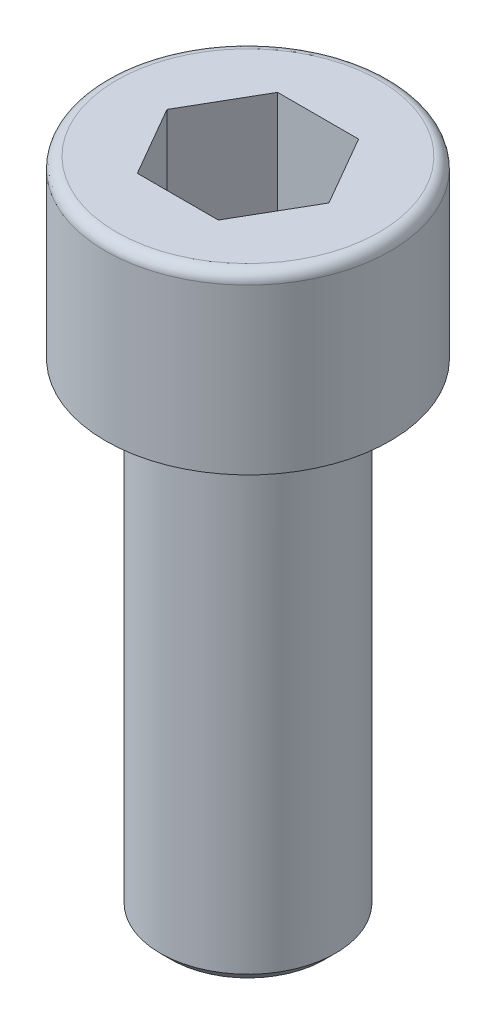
from build123d import *

# Parameters (mm, degrees)
SKETCH1_R           = 6.5
BOSS_EXTRUDE1_DEPTH = 4
SKETCH2_R           = 4
BOSS_EXTRUDE2_DEPTH = 22
SKETCH3_OUTSIDE_W   = 72.038
SKETCH3_OUTSIDE_H   = 72.038
SKETCH3_OUTSIDE_R   = 3.5
CUT_EXTRUDE1_DEPTH  = 25
CUT_EXTRUDE1_DRAFT  = -45
CUT_EXTRUDE2_DEPTH  = 5
FILLET1_R           = 0.5


with BuildPart() as part:
    # Sketch1 → Boss-Extrude1 (new, symmetric)
    with BuildSketch(Plane(origin=(0, 0, 0), x_dir=(1, 0, 0), z_dir=(0, 1, 0))):
        with Locations(Location((0, 0, 0), (0, 0, 270))):
            Circle(SKETCH1_R)
    extrude(amount=BOSS_EXTRUDE1_DEPTH, both=True)

    # Sketch2 → Boss-Extrude2 (add)
    with BuildSketch(Plane.XZ.offset(4)):
        with Locations(Location((0, 0, 0), (0, 0, 90))):
            Circle(SKETCH2_R)
    extrude(amount=BOSS_EXTRUDE2_DEPTH)


with BuildPart() as cut_extrude1_tool:
    # Sketch3 outside → Cut-Extrude1 (with draft: the straight prism first)
    with BuildSketch(Plane.XZ.offset(26)):
        Rectangle(SKETCH3_OUTSIDE_W, SKETCH3_OUTSIDE_H)
        Circle(SKETCH3_OUTSIDE_R, mode=Mode.SUBTRACT)
    extrude(amount=-CUT_EXTRUDE1_DEPTH)
    # Cut-Extrude1: the draft: its side faces are tilted about the plane it starts from
    cut_extrude1_sides = [cut_extrude1_tool.faces().sort_by_distance(p)[0] for p in [
        (0, -13.5, -36.019),
        (36.019, -13.5, 0),
        (0, -13.5, 36.019),
        (-36.019, -13.5, 0),
        (-3.5, -13.5, 0),
    ]]
    draft(cut_extrude1_sides, Plane.XZ.offset(26), CUT_EXTRUDE1_DRAFT)


with BuildPart() as part_1:
    add(part.part)

    # Cut-Extrude1: cut by cut_extrude1_tool
    add(cut_extrude1_tool.part, mode=Mode.SUBTRACT)

    # Sketch4 → Cut-Extrude2 (cut)
    with BuildSketch(Plane(origin=(0, 4, 0), x_dir=(1, 0, 0), z_dir=(0, 1, 0))):
        Polygon((1.847520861, 3.2), (-1.847520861, 3.2), (-3.695041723, 0), (-1.847520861, -3.2), (1.847520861, -3.2), (3.695041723, 0), align=None)
    extrude(amount=-CUT_EXTRUDE2_DEPTH, mode=Mode.SUBTRACT)

    # Fillet1
    fillet1_edges = [part_1.edges().sort_by_distance(p)[0] for p in [
        (0, 4, -6.5),
    ]]
    fillet(fillet1_edges, radius=FILLET1_R)


solid = part_1.part
